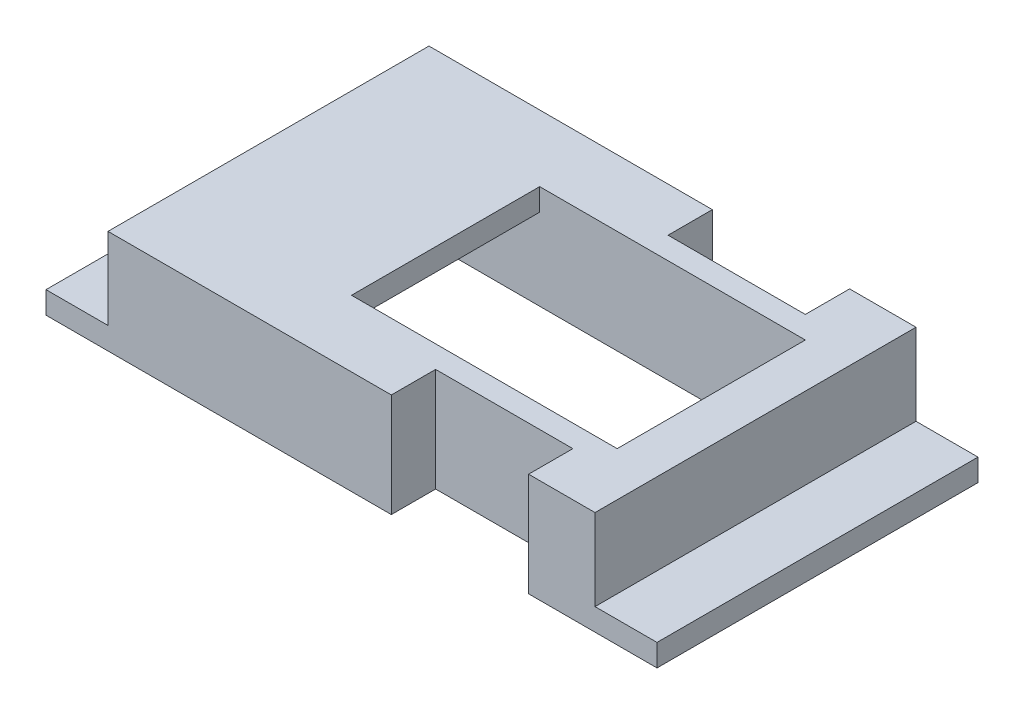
ISO-10303-21;
HEADER;
FILE_DESCRIPTION(('STEP AP214'),'2;1');
FILE_NAME('part.step','',(''),(''),'','','');
FILE_SCHEMA(('AUTOMOTIVE_DESIGN { 1 0 10303 214 1 1 1 1 }'));
ENDSEC;
DATA;
#1=APPLICATION_CONTEXT('core data for automotive mechanical design processes');
#2=APPLICATION_PROTOCOL_DEFINITION('international standard','automotive_design',2000,#1);
#3=PRODUCT_CONTEXT('',#1,'mechanical');
#4=PRODUCT('Part','Part','',(#3));
#5=PRODUCT_RELATED_PRODUCT_CATEGORY('part','',(#4));
#6=PRODUCT_DEFINITION_FORMATION('','',#4);
#7=PRODUCT_DEFINITION_CONTEXT('part definition',#1,'design');
#8=PRODUCT_DEFINITION('design','',#6,#7);
#9=PRODUCT_DEFINITION_SHAPE('','',#8);
#10=(LENGTH_UNIT() NAMED_UNIT(*) SI_UNIT(.MILLI.,.METRE.));
#11=(NAMED_UNIT(*) PLANE_ANGLE_UNIT() SI_UNIT($,.RADIAN.));
#12=(NAMED_UNIT(*) SI_UNIT($,.STERADIAN.) SOLID_ANGLE_UNIT());
#13=UNCERTAINTY_MEASURE_WITH_UNIT(LENGTH_MEASURE(1.E-05),#10,'distance_accuracy_value','');
#14=(GEOMETRIC_REPRESENTATION_CONTEXT(3) GLOBAL_UNCERTAINTY_ASSIGNED_CONTEXT((#13)) GLOBAL_UNIT_ASSIGNED_CONTEXT((#10,
#11,#12)) REPRESENTATION_CONTEXT('',''));
#15=CARTESIAN_POINT('',(0.,0.,0.));
#16=DIRECTION('',(0.,0.,1.));
#17=DIRECTION('',(1.,0.,0.));
#18=AXIS2_PLACEMENT_3D('',#15,#16,#17);
#19=CARTESIAN_POINT('',(0.,0.,-2.));
#20=DIRECTION('',(0.,0.,1.));
#21=DIRECTION('',(1.,0.,0.));
#22=AXIS2_PLACEMENT_3D('',#19,#20,#21);
#23=PLANE('',#22);
#24=DIRECTION('',(-1.,0.,0.));
#25=VECTOR('',#24,1.);
#26=CARTESIAN_POINT('',(23.8,16.2013865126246,-2.));
#27=LINE('',#26,#25);
#28=CARTESIAN_POINT('',(23.8,16.2013865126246,-2.));
#29=VERTEX_POINT('',#28);
#30=CARTESIAN_POINT('',(18.,16.2013865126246,-2.));
#31=VERTEX_POINT('',#30);
#32=EDGE_CURVE('E308',#29,#31,#27,.T.);
#33=ORIENTED_EDGE('',*,*,#32,.T.);
#34=DIRECTION('',(0.,-1.,0.));
#35=VECTOR('',#34,1.);
#36=CARTESIAN_POINT('',(18.,20.8816853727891,-2.));
#37=LINE('',#36,#35);
#38=CARTESIAN_POINT('',(18.,20.8816853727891,-2.));
#39=VERTEX_POINT('',#38);
#40=EDGE_CURVE('E198',#39,#31,#37,.T.);
#41=ORIENTED_EDGE('',*,*,#40,.F.);
#42=DIRECTION('',(1.,0.,0.));
#43=VECTOR('',#42,1.);
#44=CARTESIAN_POINT('',(-1.,20.8816853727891,-2.));
#45=LINE('',#44,#43);
#46=CARTESIAN_POINT('',(21.,20.8816853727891,-2.));
#47=VERTEX_POINT('',#46);
#48=EDGE_CURVE('E294',#39,#47,#45,.T.);
#49=ORIENTED_EDGE('',*,*,#48,.T.);
#50=DIRECTION('',(0.,-1.,0.));
#51=VECTOR('',#50,1.);
#52=CARTESIAN_POINT('',(21.,20.8816853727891,-2.));
#53=LINE('',#52,#51);
#54=CARTESIAN_POINT('',(21.,17.2013865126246,-2.));
#55=VERTEX_POINT('',#54);
#56=EDGE_CURVE('E298',#47,#55,#53,.T.);
#57=ORIENTED_EDGE('',*,*,#56,.T.);
#58=DIRECTION('',(1.,0.,0.));
#59=VECTOR('',#58,1.);
#60=CARTESIAN_POINT('',(21.,17.2013865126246,-2.));
#61=LINE('',#60,#59);
#62=CARTESIAN_POINT('',(23.8,17.2013865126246,-2.));
#63=VERTEX_POINT('',#62);
#64=EDGE_CURVE('E301',#55,#63,#61,.T.);
#65=ORIENTED_EDGE('',*,*,#64,.T.);
#66=DIRECTION('',(0.,-1.,0.));
#67=VECTOR('',#66,1.);
#68=CARTESIAN_POINT('',(23.8,17.2013865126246,-2.));
#69=LINE('',#68,#67);
#70=EDGE_CURVE('E304',#63,#29,#69,.T.);
#71=ORIENTED_EDGE('',*,*,#70,.T.);
#72=EDGE_LOOP('',(#33,#41,#49,#57,#65,#71));
#73=FACE_BOUND('',#72,.T.);
#74=ADVANCED_FACE('F33',(#73),#23,.F.);
#75=CARTESIAN_POINT('',(0.,0.,12.5));
#76=DIRECTION('',(0.,0.,1.));
#77=DIRECTION('',(1.,0.,0.));
#78=AXIS2_PLACEMENT_3D('',#75,#76,#77);
#79=PLANE('',#78);
#80=DIRECTION('',(0.,-1.,0.));
#81=VECTOR('',#80,1.);
#82=CARTESIAN_POINT('',(11.8,20.8816853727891,12.5));
#83=LINE('',#82,#81);
#84=CARTESIAN_POINT('',(11.8,20.8816853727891,12.5));
#85=VERTEX_POINT('',#84);
#86=CARTESIAN_POINT('',(11.8,16.2013865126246,12.5));
#87=VERTEX_POINT('',#86);
#88=EDGE_CURVE('E225',#85,#87,#83,.T.);
#89=ORIENTED_EDGE('',*,*,#88,.F.);
#90=DIRECTION('',(-1.,0.,0.));
#91=VECTOR('',#90,1.);
#92=CARTESIAN_POINT('',(21.,20.8816853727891,12.5));
#93=LINE('',#92,#91);
#94=CARTESIAN_POINT('',(-1.,20.8816853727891,12.5));
#95=VERTEX_POINT('',#94);
#96=EDGE_CURVE('E329',#85,#95,#93,.T.);
#97=ORIENTED_EDGE('',*,*,#96,.T.);
#98=DIRECTION('',(0.,-1.,0.));
#99=VECTOR('',#98,1.);
#100=CARTESIAN_POINT('',(-1.,20.8816853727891,12.5));
#101=LINE('',#100,#99);
#102=CARTESIAN_POINT('',(-1.,17.2013865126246,12.5));
#103=VERTEX_POINT('',#102);
#104=EDGE_CURVE('E333',#95,#103,#101,.T.);
#105=ORIENTED_EDGE('',*,*,#104,.T.);
#106=DIRECTION('',(-1.,0.,0.));
#107=VECTOR('',#106,1.);
#108=CARTESIAN_POINT('',(-1.,17.2013865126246,12.5));
#109=LINE('',#108,#107);
#110=CARTESIAN_POINT('',(-3.8,17.2013865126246,12.5));
#111=VERTEX_POINT('',#110);
#112=EDGE_CURVE('E336',#103,#111,#109,.T.);
#113=ORIENTED_EDGE('',*,*,#112,.T.);
#114=DIRECTION('',(0.,-1.,0.));
#115=VECTOR('',#114,1.);
#116=CARTESIAN_POINT('',(-3.8,17.2013865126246,12.5));
#117=LINE('',#116,#115);
#118=CARTESIAN_POINT('',(-3.8,16.2013865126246,12.5));
#119=VERTEX_POINT('',#118);
#120=EDGE_CURVE('E313',#111,#119,#117,.T.);
#121=ORIENTED_EDGE('',*,*,#120,.T.);
#122=DIRECTION('',(1.,0.,0.));
#123=VECTOR('',#122,1.);
#124=CARTESIAN_POINT('',(-3.8,16.2013865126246,12.5));
#125=LINE('',#124,#123);
#126=EDGE_CURVE('E317',#119,#87,#125,.T.);
#127=ORIENTED_EDGE('',*,*,#126,.T.);
#128=EDGE_LOOP('',(#89,#97,#105,#113,#121,#127));
#129=FACE_BOUND('',#128,.T.);
#130=ADVANCED_FACE('F427',(#129),#79,.T.);
#131=CARTESIAN_POINT('',(0.,29.8816853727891,9.5));
#132=DIRECTION('',(0.,0.,1.));
#133=DIRECTION('',(1.,0.,0.));
#134=AXIS2_PLACEMENT_3D('',#131,#132,#133);
#135=PLANE('',#134);
#136=DIRECTION('',(1.,0.,0.));
#137=VECTOR('',#136,1.);
#138=CARTESIAN_POINT('',(19.,19.8816853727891,9.5));
#139=LINE('',#138,#137);
#140=CARTESIAN_POINT('',(19.,19.8816853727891,9.5));
#141=VERTEX_POINT('',#140);
#142=CARTESIAN_POINT('',(20.,19.8816853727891,9.5));
#143=VERTEX_POINT('',#142);
#144=EDGE_CURVE('E264',#141,#143,#139,.T.);
#145=ORIENTED_EDGE('',*,*,#144,.T.);
#146=DIRECTION('',(0.,-1.,0.));
#147=VECTOR('',#146,1.);
#148=CARTESIAN_POINT('',(20.,29.8816853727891,9.5));
#149=LINE('',#148,#147);
#150=CARTESIAN_POINT('',(20.,16.2013865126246,9.5));
#151=VERTEX_POINT('',#150);
#152=EDGE_CURVE('E349',#143,#151,#149,.T.);
#153=ORIENTED_EDGE('',*,*,#152,.T.);
#154=DIRECTION('',(-1.,0.,0.));
#155=VECTOR('',#154,1.);
#156=CARTESIAN_POINT('',(0.,16.2013865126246,9.5));
#157=LINE('',#156,#155);
#158=CARTESIAN_POINT('',(0.,16.2013865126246,9.5));
#159=VERTEX_POINT('',#158);
#160=EDGE_CURVE('E339',#151,#159,#157,.T.);
#161=ORIENTED_EDGE('',*,*,#160,.T.);
#162=DIRECTION('',(0.,-1.,0.));
#163=VECTOR('',#162,1.);
#164=CARTESIAN_POINT('',(0.,29.8816853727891,9.5));
#165=LINE('',#164,#163);
#166=CARTESIAN_POINT('',(0.,19.8816853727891,9.5));
#167=VERTEX_POINT('',#166);
#168=EDGE_CURVE('E346',#167,#159,#165,.T.);
#169=ORIENTED_EDGE('',*,*,#168,.F.);
#170=DIRECTION('',(-1.,0.,0.));
#171=VECTOR('',#170,1.);
#172=CARTESIAN_POINT('',(7.,19.8816853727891,9.5));
#173=LINE('',#172,#171);
#174=CARTESIAN_POINT('',(7.,19.8816853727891,9.5));
#175=VERTEX_POINT('',#174);
#176=EDGE_CURVE('E286',#175,#167,#173,.T.);
#177=ORIENTED_EDGE('',*,*,#176,.F.);
#178=DIRECTION('',(0.,-1.,0.));
#179=VECTOR('',#178,1.);
#180=CARTESIAN_POINT('',(7.,20.8816853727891,9.5));
#181=LINE('',#180,#179);
#182=CARTESIAN_POINT('',(7.,20.8816853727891,9.5));
#183=VERTEX_POINT('',#182);
#184=EDGE_CURVE('E271',#183,#175,#181,.T.);
#185=ORIENTED_EDGE('',*,*,#184,.F.);
#186=DIRECTION('',(-1.,0.,0.));
#187=VECTOR('',#186,1.);
#188=CARTESIAN_POINT('',(-1.,20.8816853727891,9.5));
#189=LINE('',#188,#187);
#190=CARTESIAN_POINT('',(19.,20.8816853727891,9.5));
#191=VERTEX_POINT('',#190);
#192=EDGE_CURVE('E11',#191,#183,#189,.T.);
#193=ORIENTED_EDGE('',*,*,#192,.F.);
#194=DIRECTION('',(0.,1.,0.));
#195=VECTOR('',#194,1.);
#196=CARTESIAN_POINT('',(19.,20.8816853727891,9.5));
#197=LINE('',#196,#195);
#198=EDGE_CURVE('E260',#141,#191,#197,.T.);
#199=ORIENTED_EDGE('',*,*,#198,.F.);
#200=EDGE_LOOP('',(#145,#153,#161,#169,#177,#185,#193,#199));
#201=FACE_BOUND('',#200,.T.);
#202=ADVANCED_FACE('F394',(#201),#135,.F.);
#203=CARTESIAN_POINT('',(0.,29.8816853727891,1.));
#204=DIRECTION('',(0.,0.,-1.));
#205=DIRECTION('',(-1.,0.,0.));
#206=AXIS2_PLACEMENT_3D('',#203,#204,#205);
#207=PLANE('',#206);
#208=DIRECTION('',(1.,0.,0.));
#209=VECTOR('',#208,1.);
#210=CARTESIAN_POINT('',(19.,19.8816853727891,1.));
#211=LINE('',#210,#209);
#212=CARTESIAN_POINT('',(19.,19.8816853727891,1.));
#213=VERTEX_POINT('',#212);
#214=CARTESIAN_POINT('',(20.,19.8816853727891,1.));
#215=VERTEX_POINT('',#214);
#216=EDGE_CURVE('E268',#213,#215,#211,.T.);
#217=ORIENTED_EDGE('',*,*,#216,.F.);
#218=DIRECTION('',(0.,-1.,0.));
#219=VECTOR('',#218,1.);
#220=CARTESIAN_POINT('',(19.,20.8816853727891,1.));
#221=LINE('',#220,#219);
#222=CARTESIAN_POINT('',(19.,20.8816853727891,1.));
#223=VERTEX_POINT('',#222);
#224=EDGE_CURVE('E255',#223,#213,#221,.T.);
#225=ORIENTED_EDGE('',*,*,#224,.F.);
#226=DIRECTION('',(1.,0.,0.));
#227=VECTOR('',#226,1.);
#228=CARTESIAN_POINT('',(-1.,20.8816853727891,0.999999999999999));
#229=LINE('',#228,#227);
#230=CARTESIAN_POINT('',(7.,20.8816853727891,1.));
#231=VERTEX_POINT('',#230);
#232=EDGE_CURVE('E41',#231,#223,#229,.T.);
#233=ORIENTED_EDGE('',*,*,#232,.F.);
#234=DIRECTION('',(0.,1.,0.));
#235=VECTOR('',#234,1.);
#236=CARTESIAN_POINT('',(7.,20.8816853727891,1.));
#237=LINE('',#236,#235);
#238=CARTESIAN_POINT('',(7.,19.8816853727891,1.));
#239=VERTEX_POINT('',#238);
#240=EDGE_CURVE('E277',#239,#231,#237,.T.);
#241=ORIENTED_EDGE('',*,*,#240,.F.);
#242=DIRECTION('',(-1.,0.,0.));
#243=VECTOR('',#242,1.);
#244=CARTESIAN_POINT('',(7.,19.8816853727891,1.));
#245=LINE('',#244,#243);
#246=CARTESIAN_POINT('',(0.,19.8816853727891,1.));
#247=VERTEX_POINT('',#246);
#248=EDGE_CURVE('E282',#239,#247,#245,.T.);
#249=ORIENTED_EDGE('',*,*,#248,.T.);
#250=DIRECTION('',(0.,-1.,0.));
#251=VECTOR('',#250,1.);
#252=CARTESIAN_POINT('',(0.,29.8816853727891,1.));
#253=LINE('',#252,#251);
#254=CARTESIAN_POINT('',(0.,16.2013865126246,1.));
#255=VERTEX_POINT('',#254);
#256=EDGE_CURVE('E345',#247,#255,#253,.T.);
#257=ORIENTED_EDGE('',*,*,#256,.T.);
#258=DIRECTION('',(1.,0.,0.));
#259=VECTOR('',#258,1.);
#260=CARTESIAN_POINT('',(20.,16.2013865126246,1.));
#261=LINE('',#260,#259);
#262=CARTESIAN_POINT('',(20.,16.2013865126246,1.));
#263=VERTEX_POINT('',#262);
#264=EDGE_CURVE('E342',#255,#263,#261,.T.);
#265=ORIENTED_EDGE('',*,*,#264,.T.);
#266=DIRECTION('',(0.,-1.,0.));
#267=VECTOR('',#266,1.);
#268=CARTESIAN_POINT('',(20.,29.8816853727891,1.));
#269=LINE('',#268,#267);
#270=EDGE_CURVE('E351',#215,#263,#269,.T.);
#271=ORIENTED_EDGE('',*,*,#270,.F.);
#272=EDGE_LOOP('',(#217,#225,#233,#241,#249,#257,#265,#271));
#273=FACE_BOUND('',#272,.T.);
#274=ADVANCED_FACE('F387',(#273),#207,.F.);
#275=CARTESIAN_POINT('',(20.,16.2013865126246,10.5));
#276=DIRECTION('',(1.,0.,0.));
#277=DIRECTION('',(0.,0.,-1.));
#278=AXIS2_PLACEMENT_3D('',#275,#276,#277);
#279=PLANE('',#278);
#280=DIRECTION('',(0.,0.,1.));
#281=VECTOR('',#280,1.);
#282=CARTESIAN_POINT('',(20.,19.8816853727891,1.));
#283=LINE('',#282,#281);
#284=EDGE_CURVE('E248',#215,#143,#283,.T.);
#285=ORIENTED_EDGE('',*,*,#284,.F.);
#286=ORIENTED_EDGE('',*,*,#270,.T.);
#287=DIRECTION('',(0.,0.,-1.));
#288=VECTOR('',#287,1.);
#289=CARTESIAN_POINT('',(20.,16.2013865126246,10.5));
#290=LINE('',#289,#288);
#291=EDGE_CURVE('E364',#151,#263,#290,.T.);
#292=ORIENTED_EDGE('',*,*,#291,.F.);
#293=ORIENTED_EDGE('',*,*,#152,.F.);
#294=EDGE_LOOP('',(#285,#286,#292,#293));
#295=FACE_BOUND('',#294,.T.);
#296=ADVANCED_FACE('F414',(#295),#279,.F.);
#297=CARTESIAN_POINT('',(0.,16.2013865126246,10.5));
#298=DIRECTION('',(-1.,0.,0.));
#299=DIRECTION('',(0.,0.,1.));
#300=AXIS2_PLACEMENT_3D('',#297,#298,#299);
#301=PLANE('',#300);
#302=DIRECTION('',(0.,0.,-1.));
#303=VECTOR('',#302,1.);
#304=CARTESIAN_POINT('',(0.,19.8816853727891,9.5));
#305=LINE('',#304,#303);
#306=EDGE_CURVE('E270',#167,#247,#305,.T.);
#307=ORIENTED_EDGE('',*,*,#306,.F.);
#308=ORIENTED_EDGE('',*,*,#168,.T.);
#309=DIRECTION('',(0.,0.,-1.));
#310=VECTOR('',#309,1.);
#311=CARTESIAN_POINT('',(0.,16.2013865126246,10.5));
#312=LINE('',#311,#310);
#313=EDGE_CURVE('E367',#159,#255,#312,.T.);
#314=ORIENTED_EDGE('',*,*,#313,.T.);
#315=ORIENTED_EDGE('',*,*,#256,.F.);
#316=EDGE_LOOP('',(#307,#308,#314,#315));
#317=FACE_BOUND('',#316,.T.);
#318=ADVANCED_FACE('F405',(#317),#301,.F.);
#319=CARTESIAN_POINT('',(-1.,17.2013865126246,10.5));
#320=DIRECTION('',(1.,0.,0.));
#321=DIRECTION('',(0.,0.,-1.));
#322=AXIS2_PLACEMENT_3D('',#319,#320,#321);
#323=PLANE('',#322);
#324=DIRECTION('',(0.,0.,-1.));
#325=VECTOR('',#324,1.);
#326=CARTESIAN_POINT('',(-1.,20.8816853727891,10.5));
#327=LINE('',#326,#325);
#328=CARTESIAN_POINT('',(-1.,20.8816853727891,-2.));
#329=VERTEX_POINT('',#328);
#330=EDGE_CURVE('E348',#95,#329,#327,.T.);
#331=ORIENTED_EDGE('',*,*,#330,.T.);
#332=DIRECTION('',(0.,1.,0.));
#333=VECTOR('',#332,1.);
#334=CARTESIAN_POINT('',(-1.,17.2013865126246,-2.));
#335=LINE('',#334,#333);
#336=CARTESIAN_POINT('',(-1.,17.2013865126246,-2.));
#337=VERTEX_POINT('',#336);
#338=EDGE_CURVE('E291',#337,#329,#335,.T.);
#339=ORIENTED_EDGE('',*,*,#338,.F.);
#340=DIRECTION('',(0.,0.,-1.));
#341=VECTOR('',#340,1.);
#342=CARTESIAN_POINT('',(-1.,17.2013865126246,10.5));
#343=LINE('',#342,#341);
#344=EDGE_CURVE('E375',#103,#337,#343,.T.);
#345=ORIENTED_EDGE('',*,*,#344,.F.);
#346=ORIENTED_EDGE('',*,*,#104,.F.);
#347=EDGE_LOOP('',(#331,#339,#345,#346));
#348=FACE_BOUND('',#347,.T.);
#349=ADVANCED_FACE('F35',(#348),#323,.F.);
#350=CARTESIAN_POINT('',(-1.,17.2013865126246,10.5));
#351=DIRECTION('',(0.,-1.,0.));
#352=DIRECTION('',(0.,0.,-1.));
#353=AXIS2_PLACEMENT_3D('',#350,#351,#352);
#354=PLANE('',#353);
#355=ORIENTED_EDGE('',*,*,#344,.T.);
#356=DIRECTION('',(1.,0.,0.));
#357=VECTOR('',#356,1.);
#358=CARTESIAN_POINT('',(-3.8,17.2013865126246,-2.));
#359=LINE('',#358,#357);
#360=CARTESIAN_POINT('',(-3.8,17.2013865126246,-2.));
#361=VERTEX_POINT('',#360);
#362=EDGE_CURVE('E288',#361,#337,#359,.T.);
#363=ORIENTED_EDGE('',*,*,#362,.F.);
#364=DIRECTION('',(0.,0.,-1.));
#365=VECTOR('',#364,1.);
#366=CARTESIAN_POINT('',(-3.8,17.2013865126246,10.5));
#367=LINE('',#366,#365);
#368=EDGE_CURVE('E373',#111,#361,#367,.T.);
#369=ORIENTED_EDGE('',*,*,#368,.F.);
#370=ORIENTED_EDGE('',*,*,#112,.F.);
#371=EDGE_LOOP('',(#355,#363,#369,#370));
#372=FACE_BOUND('',#371,.T.);
#373=ADVANCED_FACE('F484',(#372),#354,.F.);
#374=CARTESIAN_POINT('',(-3.8,17.2013865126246,10.5));
#375=DIRECTION('',(1.,0.,0.));
#376=DIRECTION('',(0.,0.,-1.));
#377=AXIS2_PLACEMENT_3D('',#374,#375,#376);
#378=PLANE('',#377);
#379=ORIENTED_EDGE('',*,*,#368,.T.);
#380=DIRECTION('',(0.,1.,0.));
#381=VECTOR('',#380,1.);
#382=CARTESIAN_POINT('',(-3.8,16.2013865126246,-2.));
#383=LINE('',#382,#381);
#384=CARTESIAN_POINT('',(-3.8,16.2013865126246,-2.));
#385=VERTEX_POINT('',#384);
#386=EDGE_CURVE('E310',#385,#361,#383,.T.);
#387=ORIENTED_EDGE('',*,*,#386,.F.);
#388=DIRECTION('',(0.,0.,-1.));
#389=VECTOR('',#388,1.);
#390=CARTESIAN_POINT('',(-3.8,16.2013865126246,10.5));
#391=LINE('',#390,#389);
#392=EDGE_CURVE('E370',#119,#385,#391,.T.);
#393=ORIENTED_EDGE('',*,*,#392,.F.);
#394=ORIENTED_EDGE('',*,*,#120,.F.);
#395=EDGE_LOOP('',(#379,#387,#393,#394));
#396=FACE_BOUND('',#395,.T.);
#397=ADVANCED_FACE('F480',(#396),#378,.F.);
#398=CARTESIAN_POINT('',(20.,16.2013865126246,10.5));
#399=DIRECTION('',(0.,1.,0.));
#400=DIRECTION('',(0.,0.,1.));
#401=AXIS2_PLACEMENT_3D('',#398,#399,#400);
#402=PLANE('',#401);
#403=ORIENTED_EDGE('',*,*,#160,.F.);
#404=ORIENTED_EDGE('',*,*,#291,.T.);
#405=ORIENTED_EDGE('',*,*,#264,.F.);
#406=ORIENTED_EDGE('',*,*,#313,.F.);
#407=EDGE_LOOP('',(#403,#404,#405,#406));
#408=FACE_BOUND('',#407,.T.);
#409=DIRECTION('',(-1.,0.,0.));
#410=VECTOR('',#409,1.);
#411=CARTESIAN_POINT('',(18.,16.2013865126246,0.));
#412=LINE('',#411,#410);
#413=CARTESIAN_POINT('',(18.,16.2013865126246,0.));
#414=VERTEX_POINT('',#413);
#415=CARTESIAN_POINT('',(11.8,16.2013865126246,0.));
#416=VERTEX_POINT('',#415);
#417=EDGE_CURVE('E209',#414,#416,#412,.T.);
#418=ORIENTED_EDGE('',*,*,#417,.F.);
#419=DIRECTION('',(0.,0.,-1.));
#420=VECTOR('',#419,1.);
#421=CARTESIAN_POINT('',(18.,16.2013865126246,0.));
#422=LINE('',#421,#420);
#423=EDGE_CURVE('E192',#414,#31,#422,.T.);
#424=ORIENTED_EDGE('',*,*,#423,.T.);
#425=ORIENTED_EDGE('',*,*,#32,.F.);
#426=DIRECTION('',(0.,0.,-1.));
#427=VECTOR('',#426,1.);
#428=CARTESIAN_POINT('',(23.8,16.2013865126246,10.5));
#429=LINE('',#428,#427);
#430=CARTESIAN_POINT('',(23.8,16.2013865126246,12.5));
#431=VERTEX_POINT('',#430);
#432=EDGE_CURVE('E362',#431,#29,#429,.T.);
#433=ORIENTED_EDGE('',*,*,#432,.F.);
#434=CARTESIAN_POINT('',(18.,16.2013865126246,12.5));
#435=VERTEX_POINT('',#434);
#436=EDGE_CURVE('E316',#435,#431,#125,.T.);
#437=ORIENTED_EDGE('',*,*,#436,.F.);
#438=DIRECTION('',(0.,0.,1.));
#439=VECTOR('',#438,1.);
#440=CARTESIAN_POINT('',(18.,16.2013865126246,10.5));
#441=LINE('',#440,#439);
#442=CARTESIAN_POINT('',(18.,16.2013865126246,10.5));
#443=VERTEX_POINT('',#442);
#444=EDGE_CURVE('E56',#443,#435,#441,.T.);
#445=ORIENTED_EDGE('',*,*,#444,.F.);
#446=DIRECTION('',(1.,0.,0.));
#447=VECTOR('',#446,1.);
#448=CARTESIAN_POINT('',(11.8,16.2013865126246,10.5));
#449=LINE('',#448,#447);
#450=CARTESIAN_POINT('',(11.8,16.2013865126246,10.5));
#451=VERTEX_POINT('',#450);
#452=EDGE_CURVE('E233',#451,#443,#449,.T.);
#453=ORIENTED_EDGE('',*,*,#452,.F.);
#454=DIRECTION('',(0.,0.,1.));
#455=VECTOR('',#454,1.);
#456=CARTESIAN_POINT('',(11.8,16.2013865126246,10.5));
#457=LINE('',#456,#455);
#458=EDGE_CURVE('E243',#451,#87,#457,.T.);
#459=ORIENTED_EDGE('',*,*,#458,.T.);
#460=ORIENTED_EDGE('',*,*,#126,.F.);
#461=ORIENTED_EDGE('',*,*,#392,.T.);
#462=CARTESIAN_POINT('',(11.8,16.2013865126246,-2.));
#463=VERTEX_POINT('',#462);
#464=EDGE_CURVE('E307',#463,#385,#27,.T.);
#465=ORIENTED_EDGE('',*,*,#464,.F.);
#466=DIRECTION('',(0.,0.,-1.));
#467=VECTOR('',#466,1.);
#468=CARTESIAN_POINT('',(11.8,16.2013865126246,0.));
#469=LINE('',#468,#467);
#470=EDGE_CURVE('E48',#416,#463,#469,.T.);
#471=ORIENTED_EDGE('',*,*,#470,.F.);
#472=EDGE_LOOP('',(#418,#424,#425,#433,#437,#445,#453,#459,#460,#461,#465,#471));
#473=FACE_BOUND('',#472,.T.);
#474=ADVANCED_FACE('F214',(#408,#473),#402,.F.);
#475=CARTESIAN_POINT('',(23.8,17.2013865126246,10.5));
#476=DIRECTION('',(-1.,0.,0.));
#477=DIRECTION('',(0.,0.,1.));
#478=AXIS2_PLACEMENT_3D('',#475,#476,#477);
#479=PLANE('',#478);
#480=ORIENTED_EDGE('',*,*,#432,.T.);
#481=ORIENTED_EDGE('',*,*,#70,.F.);
#482=DIRECTION('',(0.,0.,-1.));
#483=VECTOR('',#482,1.);
#484=CARTESIAN_POINT('',(23.8,17.2013865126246,10.5));
#485=LINE('',#484,#483);
#486=CARTESIAN_POINT('',(23.8,17.2013865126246,12.5));
#487=VERTEX_POINT('',#486);
#488=EDGE_CURVE('E360',#487,#63,#485,.T.);
#489=ORIENTED_EDGE('',*,*,#488,.F.);
#490=DIRECTION('',(0.,1.,0.));
#491=VECTOR('',#490,1.);
#492=CARTESIAN_POINT('',(23.8,16.2013865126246,12.5));
#493=LINE('',#492,#491);
#494=EDGE_CURVE('E320',#431,#487,#493,.T.);
#495=ORIENTED_EDGE('',*,*,#494,.F.);
#496=EDGE_LOOP('',(#480,#481,#489,#495));
#497=FACE_BOUND('',#496,.T.);
#498=ADVANCED_FACE('F493',(#497),#479,.F.);
#499=CARTESIAN_POINT('',(21.,17.2013865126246,10.5));
#500=DIRECTION('',(0.,-1.,0.));
#501=DIRECTION('',(0.,0.,-1.));
#502=AXIS2_PLACEMENT_3D('',#499,#500,#501);
#503=PLANE('',#502);
#504=ORIENTED_EDGE('',*,*,#488,.T.);
#505=ORIENTED_EDGE('',*,*,#64,.F.);
#506=DIRECTION('',(0.,0.,-1.));
#507=VECTOR('',#506,1.);
#508=CARTESIAN_POINT('',(21.,17.2013865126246,10.5));
#509=LINE('',#508,#507);
#510=CARTESIAN_POINT('',(21.,17.2013865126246,12.5));
#511=VERTEX_POINT('',#510);
#512=EDGE_CURVE('E358',#511,#55,#509,.T.);
#513=ORIENTED_EDGE('',*,*,#512,.F.);
#514=DIRECTION('',(-1.,0.,0.));
#515=VECTOR('',#514,1.);
#516=CARTESIAN_POINT('',(23.8,17.2013865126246,12.5));
#517=LINE('',#516,#515);
#518=EDGE_CURVE('E323',#487,#511,#517,.T.);
#519=ORIENTED_EDGE('',*,*,#518,.F.);
#520=EDGE_LOOP('',(#504,#505,#513,#519));
#521=FACE_BOUND('',#520,.T.);
#522=ADVANCED_FACE('F497',(#521),#503,.F.);
#523=CARTESIAN_POINT('',(21.,17.2013865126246,10.5));
#524=DIRECTION('',(-1.,0.,0.));
#525=DIRECTION('',(0.,0.,1.));
#526=AXIS2_PLACEMENT_3D('',#523,#524,#525);
#527=PLANE('',#526);
#528=ORIENTED_EDGE('',*,*,#512,.T.);
#529=ORIENTED_EDGE('',*,*,#56,.F.);
#530=DIRECTION('',(0.,0.,-1.));
#531=VECTOR('',#530,1.);
#532=CARTESIAN_POINT('',(21.,20.8816853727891,10.5));
#533=LINE('',#532,#531);
#534=CARTESIAN_POINT('',(21.,20.8816853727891,12.5));
#535=VERTEX_POINT('',#534);
#536=EDGE_CURVE('E355',#535,#47,#533,.T.);
#537=ORIENTED_EDGE('',*,*,#536,.F.);
#538=DIRECTION('',(0.,1.,0.));
#539=VECTOR('',#538,1.);
#540=CARTESIAN_POINT('',(21.,17.2013865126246,12.5));
#541=LINE('',#540,#539);
#542=EDGE_CURVE('E326',#511,#535,#541,.T.);
#543=ORIENTED_EDGE('',*,*,#542,.F.);
#544=EDGE_LOOP('',(#528,#529,#537,#543));
#545=FACE_BOUND('',#544,.T.);
#546=ADVANCED_FACE('F501',(#545),#527,.F.);
#547=CARTESIAN_POINT('',(-1.,20.8816853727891,10.5));
#548=DIRECTION('',(0.,-1.,0.));
#549=DIRECTION('',(0.,0.,-1.));
#550=AXIS2_PLACEMENT_3D('',#547,#548,#549);
#551=PLANE('',#550);
#552=ORIENTED_EDGE('',*,*,#48,.F.);
#553=DIRECTION('',(0.,0.,-1.));
#554=VECTOR('',#553,1.);
#555=CARTESIAN_POINT('',(18.,20.8816853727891,0.));
#556=LINE('',#555,#554);
#557=CARTESIAN_POINT('',(18.,20.8816853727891,0.));
#558=VERTEX_POINT('',#557);
#559=EDGE_CURVE('E223',#558,#39,#556,.T.);
#560=ORIENTED_EDGE('',*,*,#559,.F.);
#561=DIRECTION('',(1.,0.,0.));
#562=VECTOR('',#561,1.);
#563=CARTESIAN_POINT('',(18.,20.8816853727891,0.));
#564=LINE('',#563,#562);
#565=CARTESIAN_POINT('',(11.8,20.8816853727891,0.));
#566=VERTEX_POINT('',#565);
#567=EDGE_CURVE('E203',#566,#558,#564,.T.);
#568=ORIENTED_EDGE('',*,*,#567,.F.);
#569=DIRECTION('',(0.,0.,-1.));
#570=VECTOR('',#569,1.);
#571=CARTESIAN_POINT('',(11.8,20.8816853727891,0.));
#572=LINE('',#571,#570);
#573=CARTESIAN_POINT('',(11.8,20.8816853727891,-2.));
#574=VERTEX_POINT('',#573);
#575=EDGE_CURVE('E226',#566,#574,#572,.T.);
#576=ORIENTED_EDGE('',*,*,#575,.T.);
#577=EDGE_CURVE('E295',#329,#574,#45,.T.);
#578=ORIENTED_EDGE('',*,*,#577,.F.);
#579=ORIENTED_EDGE('',*,*,#330,.F.);
#580=ORIENTED_EDGE('',*,*,#96,.F.);
#581=DIRECTION('',(0.,0.,1.));
#582=VECTOR('',#581,1.);
#583=CARTESIAN_POINT('',(11.8,20.8816853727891,10.5));
#584=LINE('',#583,#582);
#585=CARTESIAN_POINT('',(11.8,20.8816853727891,10.5));
#586=VERTEX_POINT('',#585);
#587=EDGE_CURVE('E246',#586,#85,#584,.T.);
#588=ORIENTED_EDGE('',*,*,#587,.F.);
#589=DIRECTION('',(-1.,0.,0.));
#590=VECTOR('',#589,1.);
#591=CARTESIAN_POINT('',(11.8,20.8816853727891,10.5));
#592=LINE('',#591,#590);
#593=CARTESIAN_POINT('',(18.,20.8816853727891,10.5));
#594=VERTEX_POINT('',#593);
#595=EDGE_CURVE('E240',#594,#586,#592,.T.);
#596=ORIENTED_EDGE('',*,*,#595,.F.);
#597=DIRECTION('',(0.,0.,1.));
#598=VECTOR('',#597,1.);
#599=CARTESIAN_POINT('',(18.,20.8816853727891,10.5));
#600=LINE('',#599,#598);
#601=CARTESIAN_POINT('',(18.,20.8816853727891,12.5));
#602=VERTEX_POINT('',#601);
#603=EDGE_CURVE('E249',#594,#602,#600,.T.);
#604=ORIENTED_EDGE('',*,*,#603,.T.);
#605=EDGE_CURVE('E330',#535,#602,#93,.T.);
#606=ORIENTED_EDGE('',*,*,#605,.F.);
#607=ORIENTED_EDGE('',*,*,#536,.T.);
#608=EDGE_LOOP('',(#552,#560,#568,#576,#578,#579,#580,#588,#596,#604,#606,#607));
#609=FACE_BOUND('',#608,.T.);
#610=DIRECTION('',(0.,0.,-1.));
#611=VECTOR('',#610,1.);
#612=CARTESIAN_POINT('',(19.,20.8816853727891,1.));
#613=LINE('',#612,#611);
#614=EDGE_CURVE('E262',#191,#223,#613,.T.);
#615=ORIENTED_EDGE('',*,*,#614,.F.);
#616=ORIENTED_EDGE('',*,*,#192,.T.);
#617=DIRECTION('',(0.,0.,1.));
#618=VECTOR('',#617,1.);
#619=CARTESIAN_POINT('',(7.,20.8816853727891,9.5));
#620=LINE('',#619,#618);
#621=EDGE_CURVE('E279',#231,#183,#620,.T.);
#622=ORIENTED_EDGE('',*,*,#621,.F.);
#623=ORIENTED_EDGE('',*,*,#232,.T.);
#624=EDGE_LOOP('',(#615,#616,#622,#623));
#625=FACE_BOUND('',#624,.T.);
#626=ADVANCED_FACE('F381',(#609,#625),#551,.F.);
#627=DIRECTION('',(0.,1.,0.));
#628=VECTOR('',#627,1.);
#629=CARTESIAN_POINT('',(18.,20.8816853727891,12.5));
#630=LINE('',#629,#628);
#631=EDGE_CURVE('E234',#435,#602,#630,.T.);
#632=ORIENTED_EDGE('',*,*,#631,.F.);
#633=ORIENTED_EDGE('',*,*,#436,.T.);
#634=ORIENTED_EDGE('',*,*,#494,.T.);
#635=ORIENTED_EDGE('',*,*,#518,.T.);
#636=ORIENTED_EDGE('',*,*,#542,.T.);
#637=ORIENTED_EDGE('',*,*,#605,.T.);
#638=EDGE_LOOP('',(#632,#633,#634,#635,#636,#637));
#639=FACE_BOUND('',#638,.T.);
#640=ADVANCED_FACE('F436',(#639),#79,.T.);
#641=ORIENTED_EDGE('',*,*,#577,.T.);
#642=DIRECTION('',(0.,1.,0.));
#643=VECTOR('',#642,1.);
#644=CARTESIAN_POINT('',(11.8,20.8816853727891,-2.));
#645=LINE('',#644,#643);
#646=EDGE_CURVE('E212',#463,#574,#645,.T.);
#647=ORIENTED_EDGE('',*,*,#646,.F.);
#648=ORIENTED_EDGE('',*,*,#464,.T.);
#649=ORIENTED_EDGE('',*,*,#386,.T.);
#650=ORIENTED_EDGE('',*,*,#362,.T.);
#651=ORIENTED_EDGE('',*,*,#338,.T.);
#652=EDGE_LOOP('',(#641,#647,#648,#649,#650,#651));
#653=FACE_BOUND('',#652,.T.);
#654=ADVANCED_FACE('F430',(#653),#23,.F.);
#655=CARTESIAN_POINT('',(7.,19.8816853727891,9.5));
#656=DIRECTION('',(0.,1.,0.));
#657=DIRECTION('',(0.,0.,1.));
#658=AXIS2_PLACEMENT_3D('',#655,#656,#657);
#659=PLANE('',#658);
#660=ORIENTED_EDGE('',*,*,#306,.T.);
#661=ORIENTED_EDGE('',*,*,#248,.F.);
#662=DIRECTION('',(0.,0.,-1.));
#663=VECTOR('',#662,1.);
#664=CARTESIAN_POINT('',(7.,19.8816853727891,9.5));
#665=LINE('',#664,#663);
#666=EDGE_CURVE('E274',#175,#239,#665,.T.);
#667=ORIENTED_EDGE('',*,*,#666,.F.);
#668=ORIENTED_EDGE('',*,*,#176,.T.);
#669=EDGE_LOOP('',(#660,#661,#667,#668));
#670=FACE_BOUND('',#669,.T.);
#671=ADVANCED_FACE('F401',(#670),#659,.F.);
#672=CARTESIAN_POINT('',(7.,0.,0.));
#673=DIRECTION('',(1.,0.,0.));
#674=DIRECTION('',(0.,0.,-1.));
#675=AXIS2_PLACEMENT_3D('',#672,#673,#674);
#676=PLANE('',#675);
#677=ORIENTED_EDGE('',*,*,#184,.T.);
#678=ORIENTED_EDGE('',*,*,#666,.T.);
#679=ORIENTED_EDGE('',*,*,#240,.T.);
#680=ORIENTED_EDGE('',*,*,#621,.T.);
#681=EDGE_LOOP('',(#677,#678,#679,#680));
#682=FACE_BOUND('',#681,.T.);
#683=ADVANCED_FACE('F399',(#682),#676,.T.);
#684=CARTESIAN_POINT('',(19.,19.8816853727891,1.));
#685=DIRECTION('',(0.,1.,0.));
#686=DIRECTION('',(0.,0.,1.));
#687=AXIS2_PLACEMENT_3D('',#684,#685,#686);
#688=PLANE('',#687);
#689=ORIENTED_EDGE('',*,*,#284,.T.);
#690=ORIENTED_EDGE('',*,*,#144,.F.);
#691=DIRECTION('',(0.,0.,1.));
#692=VECTOR('',#691,1.);
#693=CARTESIAN_POINT('',(19.,19.8816853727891,1.));
#694=LINE('',#693,#692);
#695=EDGE_CURVE('E258',#213,#141,#694,.T.);
#696=ORIENTED_EDGE('',*,*,#695,.F.);
#697=ORIENTED_EDGE('',*,*,#216,.T.);
#698=EDGE_LOOP('',(#689,#690,#696,#697));
#699=FACE_BOUND('',#698,.T.);
#700=ADVANCED_FACE('F416',(#699),#688,.F.);
#701=CARTESIAN_POINT('',(19.,0.,0.));
#702=DIRECTION('',(-1.,0.,0.));
#703=DIRECTION('',(0.,0.,1.));
#704=AXIS2_PLACEMENT_3D('',#701,#702,#703);
#705=PLANE('',#704);
#706=ORIENTED_EDGE('',*,*,#224,.T.);
#707=ORIENTED_EDGE('',*,*,#695,.T.);
#708=ORIENTED_EDGE('',*,*,#198,.T.);
#709=ORIENTED_EDGE('',*,*,#614,.T.);
#710=EDGE_LOOP('',(#706,#707,#708,#709));
#711=FACE_BOUND('',#710,.T.);
#712=ADVANCED_FACE('F390',(#711),#705,.T.);
#713=CARTESIAN_POINT('',(11.8,20.8816853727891,10.5));
#714=DIRECTION('',(-1.,0.,0.));
#715=DIRECTION('',(0.,0.,1.));
#716=AXIS2_PLACEMENT_3D('',#713,#714,#715);
#717=PLANE('',#716);
#718=ORIENTED_EDGE('',*,*,#88,.T.);
#719=ORIENTED_EDGE('',*,*,#458,.F.);
#720=DIRECTION('',(0.,-1.,0.));
#721=VECTOR('',#720,1.);
#722=CARTESIAN_POINT('',(11.8,20.8816853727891,10.5));
#723=LINE('',#722,#721);
#724=EDGE_CURVE('E230',#586,#451,#723,.T.);
#725=ORIENTED_EDGE('',*,*,#724,.F.);
#726=ORIENTED_EDGE('',*,*,#587,.T.);
#727=EDGE_LOOP('',(#718,#719,#725,#726));
#728=FACE_BOUND('',#727,.T.);
#729=ADVANCED_FACE('F423',(#728),#717,.F.);
#730=CARTESIAN_POINT('',(18.,20.8816853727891,10.5));
#731=DIRECTION('',(1.,0.,0.));
#732=DIRECTION('',(0.,0.,-1.));
#733=AXIS2_PLACEMENT_3D('',#730,#731,#732);
#734=PLANE('',#733);
#735=ORIENTED_EDGE('',*,*,#631,.T.);
#736=ORIENTED_EDGE('',*,*,#603,.F.);
#737=DIRECTION('',(0.,1.,0.));
#738=VECTOR('',#737,1.);
#739=CARTESIAN_POINT('',(18.,20.8816853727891,10.5));
#740=LINE('',#739,#738);
#741=EDGE_CURVE('E237',#443,#594,#740,.T.);
#742=ORIENTED_EDGE('',*,*,#741,.F.);
#743=ORIENTED_EDGE('',*,*,#444,.T.);
#744=EDGE_LOOP('',(#735,#736,#742,#743));
#745=FACE_BOUND('',#744,.T.);
#746=ADVANCED_FACE('F465',(#745),#734,.F.);
#747=CARTESIAN_POINT('',(0.,0.,10.5));
#748=DIRECTION('',(0.,0.,1.));
#749=DIRECTION('',(1.,0.,0.));
#750=AXIS2_PLACEMENT_3D('',#747,#748,#749);
#751=PLANE('',#750);
#752=ORIENTED_EDGE('',*,*,#724,.T.);
#753=ORIENTED_EDGE('',*,*,#452,.T.);
#754=ORIENTED_EDGE('',*,*,#741,.T.);
#755=ORIENTED_EDGE('',*,*,#595,.T.);
#756=EDGE_LOOP('',(#752,#753,#754,#755));
#757=FACE_BOUND('',#756,.T.);
#758=ADVANCED_FACE('F460',(#757),#751,.T.);
#759=CARTESIAN_POINT('',(18.,20.8816853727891,0.));
#760=DIRECTION('',(1.,0.,0.));
#761=DIRECTION('',(0.,0.,-1.));
#762=AXIS2_PLACEMENT_3D('',#759,#760,#761);
#763=PLANE('',#762);
#764=ORIENTED_EDGE('',*,*,#40,.T.);
#765=ORIENTED_EDGE('',*,*,#423,.F.);
#766=DIRECTION('',(0.,-1.,0.));
#767=VECTOR('',#766,1.);
#768=CARTESIAN_POINT('',(18.,20.8816853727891,0.));
#769=LINE('',#768,#767);
#770=EDGE_CURVE('E195',#558,#414,#769,.T.);
#771=ORIENTED_EDGE('',*,*,#770,.F.);
#772=ORIENTED_EDGE('',*,*,#559,.T.);
#773=EDGE_LOOP('',(#764,#765,#771,#772));
#774=FACE_BOUND('',#773,.T.);
#775=ADVANCED_FACE('F194',(#774),#763,.F.);
#776=CARTESIAN_POINT('',(11.8,20.8816853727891,0.));
#777=DIRECTION('',(-1.,0.,0.));
#778=DIRECTION('',(0.,0.,1.));
#779=AXIS2_PLACEMENT_3D('',#776,#777,#778);
#780=PLANE('',#779);
#781=ORIENTED_EDGE('',*,*,#646,.T.);
#782=ORIENTED_EDGE('',*,*,#575,.F.);
#783=DIRECTION('',(0.,1.,0.));
#784=VECTOR('',#783,1.);
#785=CARTESIAN_POINT('',(11.8,20.8816853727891,0.));
#786=LINE('',#785,#784);
#787=EDGE_CURVE('E216',#416,#566,#786,.T.);
#788=ORIENTED_EDGE('',*,*,#787,.F.);
#789=ORIENTED_EDGE('',*,*,#470,.T.);
#790=EDGE_LOOP('',(#781,#782,#788,#789));
#791=FACE_BOUND('',#790,.T.);
#792=ADVANCED_FACE('F452',(#791),#780,.F.);
#793=CARTESIAN_POINT('',(0.,0.,0.));
#794=DIRECTION('',(0.,0.,-1.));
#795=DIRECTION('',(-1.,0.,0.));
#796=AXIS2_PLACEMENT_3D('',#793,#794,#795);
#797=PLANE('',#796);
#798=ORIENTED_EDGE('',*,*,#770,.T.);
#799=ORIENTED_EDGE('',*,*,#417,.T.);
#800=ORIENTED_EDGE('',*,*,#787,.T.);
#801=ORIENTED_EDGE('',*,*,#567,.T.);
#802=EDGE_LOOP('',(#798,#799,#800,#801));
#803=FACE_BOUND('',#802,.T.);
#804=ADVANCED_FACE('F207',(#803),#797,.T.);
#805=CLOSED_SHELL('',(#74,#130,#202,#274,#296,#318,#349,#373,#397,#474,#498,#522,#546,#626,#640,
#654,#671,#683,#700,#712,#729,#746,#758,#775,#792,#804));
#806=MANIFOLD_SOLID_BREP('B2',#805);
#807=ADVANCED_BREP_SHAPE_REPRESENTATION('',(#18,#806),#14);
#808=SHAPE_DEFINITION_REPRESENTATION(#9,#807);
ENDSEC;
END-ISO-10303-21;
